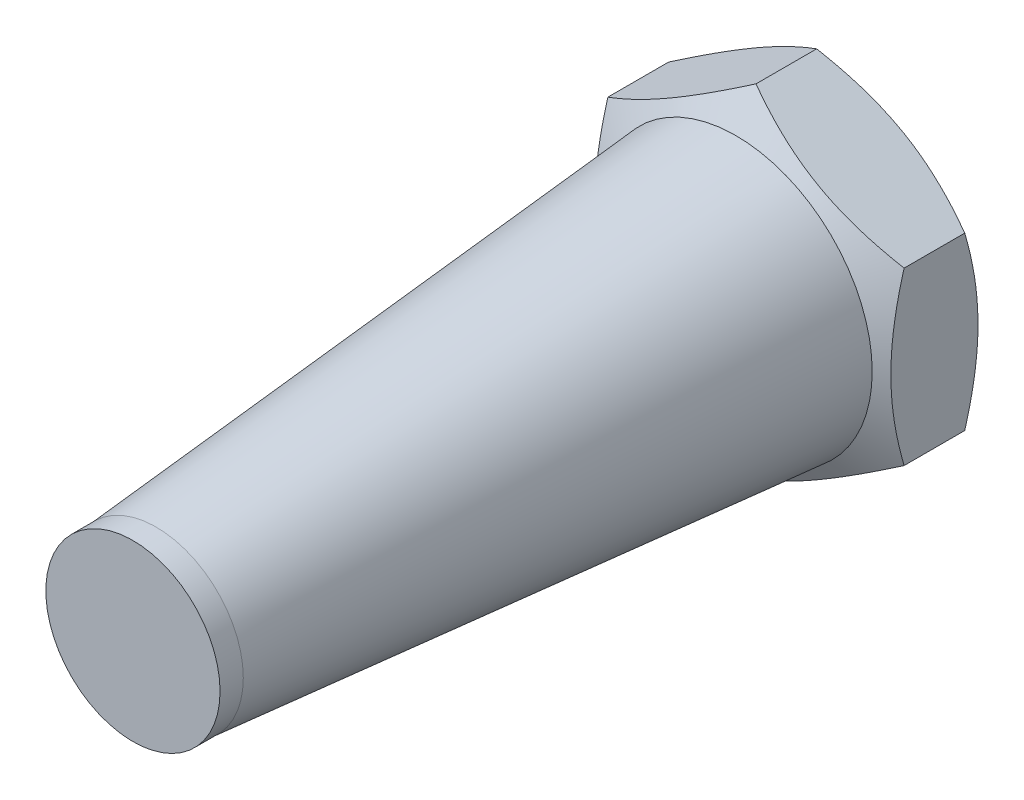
ISO-10303-21;
HEADER;
FILE_DESCRIPTION(('STEP AP214'),'2;1');
FILE_NAME('part.step','',(''),(''),'','','');
FILE_SCHEMA(('AUTOMOTIVE_DESIGN { 1 0 10303 214 1 1 1 1 }'));
ENDSEC;
DATA;
#1=APPLICATION_CONTEXT('core data for automotive mechanical design processes');
#2=APPLICATION_PROTOCOL_DEFINITION('international standard','automotive_design',2000,#1);
#3=PRODUCT_CONTEXT('',#1,'mechanical');
#4=PRODUCT('Part','Part','',(#3));
#5=PRODUCT_RELATED_PRODUCT_CATEGORY('part','',(#4));
#6=PRODUCT_DEFINITION_FORMATION('','',#4);
#7=PRODUCT_DEFINITION_CONTEXT('part definition',#1,'design');
#8=PRODUCT_DEFINITION('design','',#6,#7);
#9=PRODUCT_DEFINITION_SHAPE('','',#8);
#10=(LENGTH_UNIT() NAMED_UNIT(*) SI_UNIT(.MILLI.,.METRE.));
#11=(NAMED_UNIT(*) PLANE_ANGLE_UNIT() SI_UNIT($,.RADIAN.));
#12=(NAMED_UNIT(*) SI_UNIT($,.STERADIAN.) SOLID_ANGLE_UNIT());
#13=UNCERTAINTY_MEASURE_WITH_UNIT(LENGTH_MEASURE(1.E-05),#10,'distance_accuracy_value','');
#14=(GEOMETRIC_REPRESENTATION_CONTEXT(3) GLOBAL_UNCERTAINTY_ASSIGNED_CONTEXT((#13)) GLOBAL_UNIT_ASSIGNED_CONTEXT((#10,
#11,#12)) REPRESENTATION_CONTEXT('',''));
#15=CARTESIAN_POINT('',(0.,0.,0.));
#16=DIRECTION('',(0.,0.,1.));
#17=DIRECTION('',(1.,0.,0.));
#18=AXIS2_PLACEMENT_3D('',#15,#16,#17);
#19=CARTESIAN_POINT('',(0.,0.,2.5));
#20=DIRECTION('',(0.,0.,-1.));
#21=DIRECTION('',(-0.5,0.866025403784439,0.));
#22=AXIS2_PLACEMENT_3D('',#19,#20,#21);
#23=CONICAL_SURFACE('',#22,12.830127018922,1.04719755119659);
#24=CARTESIAN_POINT('',(0.,0.,5.3925981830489));
#25=DIRECTION('',(0.,0.,-1.));
#26=DIRECTION('',(-0.5,0.866025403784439,0.));
#27=AXIS2_PLACEMENT_3D('',#24,#25,#26);
#28=CIRCLE('',#27,7.82);
#29=CARTESIAN_POINT('',(-3.91,6.77231865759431,5.3925981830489));
#30=VERTEX_POINT('',#29);
#31=EDGE_CURVE('E280',#30,#30,#28,.T.);
#32=ORIENTED_EDGE('',*,*,#31,.T.);
#33=EDGE_LOOP('',(#32));
#34=FACE_BOUND('',#33,.T.);
#35=CARTESIAN_POINT('',(-15.6843801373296,0.759573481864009,0.841483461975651));
#36=CARTESIAN_POINT('',(-15.3627013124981,0.945294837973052,1.02175161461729));
#37=CARTESIAN_POINT('',(-15.0402860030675,1.13144140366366,1.20029735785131));
#38=CARTESIAN_POINT('',(-14.393590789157,1.50481105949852,1.55297568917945));
#39=CARTESIAN_POINT('',(-14.0693106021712,1.69203431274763,1.72710758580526));
#40=CARTESIAN_POINT('',(-13.4168321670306,2.06874291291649,2.07086132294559));
#41=CARTESIAN_POINT('',(-13.0886222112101,2.25823501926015,2.24045363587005));
#42=CARTESIAN_POINT('',(-12.4295981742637,2.63872272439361,2.57272585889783));
#43=CARTESIAN_POINT('',(-12.0987842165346,2.8297182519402,2.73540609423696));
#44=CARTESIAN_POINT('',(-11.4233012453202,3.21970852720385,3.05713795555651));
#45=CARTESIAN_POINT('',(-11.0785294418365,3.41876262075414,3.21590342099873));
#46=CARTESIAN_POINT('',(-10.3849599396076,3.81919515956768,3.52146971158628));
#47=CARTESIAN_POINT('',(-10.0361617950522,4.02057386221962,3.66826919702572));
#48=CARTESIAN_POINT('',(-9.33462727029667,4.42560500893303,3.94606509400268));
#49=CARTESIAN_POINT('',(-8.98190043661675,4.62925194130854,4.07709330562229));
#50=CARTESIAN_POINT('',(-8.27139980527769,5.03945967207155,4.31915799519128));
#51=CARTESIAN_POINT('',(-7.91362762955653,5.24601953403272,4.43020074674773));
#52=CARTESIAN_POINT('',(-7.19475057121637,5.66106339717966,4.62638435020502));
#53=CARTESIAN_POINT('',(-6.83367521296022,5.86953035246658,4.71166556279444));
#54=CARTESIAN_POINT('',(-6.28875955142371,6.18413755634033,4.81658170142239));
#55=CARTESIAN_POINT('',(-6.10655739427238,6.28933202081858,4.84772087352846));
#56=CARTESIAN_POINT('',(-5.74124120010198,6.50024742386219,4.90172040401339));
#57=CARTESIAN_POINT('',(-5.55812725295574,6.60596831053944,4.92458156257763));
#58=CARTESIAN_POINT('',(-5.19363375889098,6.8164087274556,4.96128170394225));
#59=CARTESIAN_POINT('',(-5.01226286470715,6.9211232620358,4.97523481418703));
#60=CARTESIAN_POINT('',(-4.64917257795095,7.13075353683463,4.99427112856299));
#61=CARTESIAN_POINT('',(-4.4674531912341,7.23566927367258,4.99935448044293));
#62=CARTESIAN_POINT('',(-4.10399055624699,7.44551452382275,5.00052995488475));
#63=CARTESIAN_POINT('',(-3.92224730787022,7.55044403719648,4.996622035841));
#64=CARTESIAN_POINT('',(-3.55906551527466,7.7601271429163,4.97991072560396));
#65=CARTESIAN_POINT('',(-3.37762698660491,7.86488072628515,4.96710689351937));
#66=CARTESIAN_POINT('',(-2.94215561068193,8.11630024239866,4.92597203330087));
#67=CARTESIAN_POINT('',(-2.68841284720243,8.26279869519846,4.89345749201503));
#68=CARTESIAN_POINT('',(-2.18281025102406,8.55470849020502,4.81279848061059));
#69=CARTESIAN_POINT('',(-1.9309506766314,8.7001196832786,4.76465190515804));
#70=CARTESIAN_POINT('',(-1.17848665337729,9.13455498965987,4.59931707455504));
#71=CARTESIAN_POINT('',(-0.681275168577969,9.42162017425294,4.46126348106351));
#72=CARTESIAN_POINT('',(0.0622589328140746,9.8508997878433,4.22184160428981));
#73=CARTESIAN_POINT('',(0.312436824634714,9.99534006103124,4.13551884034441));
#74=CARTESIAN_POINT('',(0.810362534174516,10.2828176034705,3.95390295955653));
#75=CARTESIAN_POINT('',(1.05811033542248,10.4258548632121,3.85860978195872));
#76=CARTESIAN_POINT('',(1.55125424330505,10.7105716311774,3.66058253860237));
#77=CARTESIAN_POINT('',(1.79665108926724,10.8522515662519,3.55785090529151));
#78=CARTESIAN_POINT('',(2.28541069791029,11.134437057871,3.34615605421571));
#79=CARTESIAN_POINT('',(2.52877348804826,11.2749426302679,3.23719292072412));
#80=CARTESIAN_POINT('',(3.11764094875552,11.6149254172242,2.96624169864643));
#81=CARTESIAN_POINT('',(3.4622099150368,11.8138624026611,2.80154663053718));
#82=CARTESIAN_POINT('',(4.14830777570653,12.2099811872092,2.46389431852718));
#83=CARTESIAN_POINT('',(4.48983645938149,12.4071628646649,2.29093650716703));
#84=CARTESIAN_POINT('',(5.17044511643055,12.800112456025,1.93847167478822));
#85=CARTESIAN_POINT('',(5.50952445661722,12.9958800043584,1.75896302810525));
#86=CARTESIAN_POINT('',(6.18557463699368,13.3861977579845,1.39476540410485));
#87=CARTESIAN_POINT('',(6.52254552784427,13.5807479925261,1.21007655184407));
#88=CARTESIAN_POINT('',(7.19513914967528,13.9690701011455,0.83629760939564));
#89=CARTESIAN_POINT('',(7.53075981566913,14.1628407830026,0.647202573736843));
#90=CARTESIAN_POINT('',(8.2005408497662,14.5495390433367,0.265595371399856));
#91=CARTESIAN_POINT('',(8.5347012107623,14.7424666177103,0.0730831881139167));
#92=CARTESIAN_POINT('',(9.20174535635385,15.1275847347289,-0.314727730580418));
#93=CARTESIAN_POINT('',(9.5346293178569,15.3197753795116,-0.510026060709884));
#94=CARTESIAN_POINT('',(10.1993580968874,15.7035567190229,-0.902967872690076));
#95=CARTESIAN_POINT('',(10.5312029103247,15.8951474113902,-1.10061136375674));
#96=CARTESIAN_POINT('',(11.4671694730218,16.4355279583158,-1.66157272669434));
#97=CARTESIAN_POINT('',(12.0702656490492,16.7837256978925,-2.02717199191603));
#98=CARTESIAN_POINT('',(13.2742599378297,17.4788521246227,-2.76321984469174));
#99=CARTESIAN_POINT('',(13.8751579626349,17.8257807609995,-3.13366862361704));
#100=CARTESIAN_POINT('',(15.0736547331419,18.5177331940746,-3.87726457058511));
#101=CARTESIAN_POINT('',(15.671258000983,18.8627596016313,-4.25040203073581));
#102=CARTESIAN_POINT('',(16.8650668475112,19.5520054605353,-4.99955126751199));
#103=CARTESIAN_POINT('',(17.4612725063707,19.8962249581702,-5.37556287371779));
#104=CARTESIAN_POINT('',(18.0569685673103,20.2401502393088,-5.75263973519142));
#105=B_SPLINE_CURVE_WITH_KNOTS('',3,(#35,#36,#37,#38,#39,#40,#41,#42,#43,#44,#45,#46,#47,#48,
#49,#50,#51,#52,#53,#54,#55,#56,#57,#58,#59,#60,#61,#62,#63,#64,#65,#66,#67,#68,#69,#70,#71,#72,
#73,#74,#75,#76,#77,#78,#79,#80,#81,#82,#83,#84,#85,#86,#87,#88,#89,#90,#91,#92,#93,#94,#95,#96,
#97,#98,#99,#100,#101,#102,#103,#104),.UNSPECIFIED.,.F.,.F.,(4,2,2,2,2,2,2,2,2,2,2,2,2,2,2,2,2,
2,2,2,2,2,2,2,2,2,2,2,2,2,2,2,2,2,4),(0.,1.23864194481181,2.47747674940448,3.72301978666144,
4.9685041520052,6.25415012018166,7.53993983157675,8.82309192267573,10.1058405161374,
11.3814685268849,12.0193739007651,12.6572175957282,13.2867161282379,13.916204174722,
14.5456951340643,15.1752172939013,16.0591048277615,16.9431114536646,18.7120884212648,
19.6165193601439,20.5209564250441,21.4250990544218,22.3292294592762,23.6209420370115,
24.9127434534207,26.204867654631,27.4969606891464,28.7905813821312,30.0842083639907,
31.3776490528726,32.6710948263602,35.0306559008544,37.3903103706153,39.7437342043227,
42.0970195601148),.UNSPECIFIED.);
#106=CARTESIAN_POINT('',(0.,9.81495457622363,4.24081062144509));
#107=VERTEX_POINT('',#106);
#108=CARTESIAN_POINT('',(-8.5,4.90747728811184,4.24081062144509));
#109=VERTEX_POINT('',#108);
#110=EDGE_CURVE('E102',#107,#109,#105,.F.);
#111=ORIENTED_EDGE('',*,*,#110,.T.);
#112=CARTESIAN_POINT('',(-8.5,4.90770822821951,4.24074395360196));
#113=CARTESIAN_POINT('',(-8.5,4.69196487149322,4.30301386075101));
#114=CARTESIAN_POINT('',(-8.5,4.47541714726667,4.36245770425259));
#115=CARTESIAN_POINT('',(-8.5,4.04056304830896,4.47491488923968));
#116=CARTESIAN_POINT('',(-8.5,3.82225595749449,4.52792545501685));
#117=CARTESIAN_POINT('',(-8.5,3.1638393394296,4.67626661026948));
#118=CARTESIAN_POINT('',(-8.5,2.72113075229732,4.76064107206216));
#119=CARTESIAN_POINT('',(-8.5,2.05862591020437,4.85957998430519));
#120=CARTESIAN_POINT('',(-8.5,1.84080885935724,4.88776480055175));
#121=CARTESIAN_POINT('',(-8.5,1.4041897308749,4.93502591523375));
#122=CARTESIAN_POINT('',(-8.5,1.18538774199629,4.95410301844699));
#123=CARTESIAN_POINT('',(-8.5,0.747407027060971,4.98266522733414));
#124=CARTESIAN_POINT('',(-8.5,0.528229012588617,4.99216121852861));
#125=CARTESIAN_POINT('',(-8.5,0.0896705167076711,5.0013576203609));
#126=CARTESIAN_POINT('',(-8.5,-0.129709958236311,5.0010583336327));
#127=CARTESIAN_POINT('',(-8.5,-0.539849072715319,4.99134552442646));
#128=CARTESIAN_POINT('',(-8.5,-0.730636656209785,4.98311683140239));
#129=CARTESIAN_POINT('',(-8.5,-1.11176497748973,4.95941075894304));
#130=CARTESIAN_POINT('',(-8.5,-1.30210568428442,4.94393289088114));
#131=CARTESIAN_POINT('',(-8.5,-1.87239091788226,4.88699137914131));
#132=CARTESIAN_POINT('',(-8.5,-2.25132599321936,4.83502693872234));
#133=CARTESIAN_POINT('',(-8.5,-3.01321579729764,4.705115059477));
#134=CARTESIAN_POINT('',(-8.5,-3.39607329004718,4.6266169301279));
#135=CARTESIAN_POINT('',(-8.5,-4.156078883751,4.44845866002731));
#136=CARTESIAN_POINT('',(-8.5,-4.53323671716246,4.34884036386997));
#137=CARTESIAN_POINT('',(-8.5,-4.90770822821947,4.24074395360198));
#138=B_SPLINE_CURVE_WITH_KNOTS('',3,(#112,#113,#114,#115,#116,#117,#118,#119,#120,#121,#122,
#123,#124,#125,#126,#127,#128,#129,#130,#131,#132,#133,#134,#135,#136,#137),.UNSPECIFIED.,.F.,
.F.,(4,2,2,2,2,2,2,2,2,2,2,2,4),(0.,0.673596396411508,1.34748239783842,2.69805431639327,
3.35679995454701,4.01548737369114,4.67342558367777,5.33134346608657,5.9040955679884,
6.47688628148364,7.62328361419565,8.79510569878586,9.96462743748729),.UNSPECIFIED.);
#139=CARTESIAN_POINT('',(-8.5,-4.9074772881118,4.2408106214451));
#140=VERTEX_POINT('',#139);
#141=EDGE_CURVE('E93',#109,#140,#138,.T.);
#142=ORIENTED_EDGE('',*,*,#141,.T.);
#143=CARTESIAN_POINT('',(-8.5002,-4.90736181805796,4.24074395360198));
#144=CARTESIAN_POINT('',(-8.31336077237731,-5.0152334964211,4.30301386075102));
#145=CARTESIAN_POINT('',(-8.1258249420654,-5.12350735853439,4.3624577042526));
#146=CARTESIAN_POINT('',(-7.74923024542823,-5.34093440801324,4.47491488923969));
#147=CARTESIAN_POINT('',(-7.56017075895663,-5.45008795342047,4.52792545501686));
#148=CARTESIAN_POINT('',(-6.9899652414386,-5.77929626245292,4.67626661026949));
#149=CARTESIAN_POINT('',(-6.60656835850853,-6.00065055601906,4.76064107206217));
#150=CARTESIAN_POINT('',(-6.03282233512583,-6.33190297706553,4.8595799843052));
#151=CARTESIAN_POINT('',(-5.8441872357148,-6.4408115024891,4.88776480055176));
#152=CARTESIAN_POINT('',(-5.46606397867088,-6.65912106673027,4.93502591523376));
#153=CARTESIAN_POINT('',(-5.27657589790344,-6.76852206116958,4.954103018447));
#154=CARTESIAN_POINT('',(-4.89727347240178,-6.98751241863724,4.98266522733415));
#155=CARTESIAN_POINT('',(-4.70745974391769,-7.09710142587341,4.99216121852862));
#156=CARTESIAN_POINT('',(-4.3276569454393,-7.31638067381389,5.00135762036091));
#157=CARTESIAN_POINT('',(-4.13766788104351,-7.42607091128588,5.0010583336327));
#158=CARTESIAN_POINT('',(-3.78247698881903,-7.63114046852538,4.99134552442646));
#159=CARTESIAN_POINT('',(-3.61725009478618,-7.72653426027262,4.9831168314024));
#160=CARTESIAN_POINT('',(-3.28718328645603,-7.91709842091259,4.95941075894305));
#161=CARTESIAN_POINT('',(-3.12234339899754,-8.01226877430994,4.94393289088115));
#162=CARTESIAN_POINT('',(-2.62846189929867,-8.29741139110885,4.88699137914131));
#163=CARTESIAN_POINT('',(-2.30029449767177,-8.48687892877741,4.83502693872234));
#164=CARTESIAN_POINT('',(-1.64047857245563,-8.86782383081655,4.705115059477));
#165=CARTESIAN_POINT('',(-1.3089142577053,-9.05925257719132,4.62661693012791));
#166=CARTESIAN_POINT('',(-0.65073010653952,-9.43925537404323,4.44845866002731));
#167=CARTESIAN_POINT('',(-0.324101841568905,-9.62783429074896,4.34884036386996));
#168=CARTESIAN_POINT('',(0.00020000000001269,-9.81507004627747,4.24074395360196));
#169=B_SPLINE_CURVE_WITH_KNOTS('',3,(#143,#144,#145,#146,#147,#148,#149,#150,#151,#152,#153,
#154,#155,#156,#157,#158,#159,#160,#161,#162,#163,#164,#165,#166,#167,#168),.UNSPECIFIED.,.F.,
.F.,(4,2,2,2,2,2,2,2,2,2,2,2,4),(0.,0.67359639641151,1.34748239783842,2.69805431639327,
3.35679995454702,4.01548737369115,4.67342558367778,5.33134346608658,5.90409556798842,
6.47688628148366,7.62328361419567,8.79510569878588,9.96462743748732),.UNSPECIFIED.);
#170=CARTESIAN_POINT('',(0.,-9.81495457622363,4.24081062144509));
#171=VERTEX_POINT('',#170);
#172=EDGE_CURVE('E82',#140,#171,#169,.T.);
#173=ORIENTED_EDGE('',*,*,#172,.T.);
#174=CARTESIAN_POINT('',(-7.18438013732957,-13.9628583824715,0.841483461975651));
#175=CARTESIAN_POINT('',(-6.86270131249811,-13.7771370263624,1.02175161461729));
#176=CARTESIAN_POINT('',(-6.54028600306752,-13.5909904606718,1.20029735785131));
#177=CARTESIAN_POINT('',(-5.89359078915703,-13.2176208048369,1.55297568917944));
#178=CARTESIAN_POINT('',(-5.56931060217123,-13.0303975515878,1.72710758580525));
#179=CARTESIAN_POINT('',(-4.91683216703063,-12.653688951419,2.07086132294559));
#180=CARTESIAN_POINT('',(-4.58862221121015,-12.4641968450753,2.24045363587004));
#181=CARTESIAN_POINT('',(-3.92959817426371,-12.0837091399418,2.57272585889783));
#182=CARTESIAN_POINT('',(-3.5987842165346,-11.8927136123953,2.73540609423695));
#183=CARTESIAN_POINT('',(-2.92330124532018,-11.5027233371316,3.05713795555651));
#184=CARTESIAN_POINT('',(-2.57852944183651,-11.3036692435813,3.21590342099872));
#185=CARTESIAN_POINT('',(-1.88495993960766,-10.9032367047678,3.52146971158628));
#186=CARTESIAN_POINT('',(-1.53616179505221,-10.7018580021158,3.66826919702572));
#187=CARTESIAN_POINT('',(-0.834627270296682,-10.2968268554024,3.94606509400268));
#188=CARTESIAN_POINT('',(-0.481900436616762,-10.0931799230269,4.07709330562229));
#189=CARTESIAN_POINT('',(0.228600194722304,-9.68297219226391,4.31915799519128));
#190=CARTESIAN_POINT('',(0.58637237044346,-9.47641233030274,4.43020074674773));
#191=CARTESIAN_POINT('',(1.30524942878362,-9.0613684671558,4.62638435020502));
#192=CARTESIAN_POINT('',(1.66632478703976,-8.85290151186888,4.71166556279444));
#193=CARTESIAN_POINT('',(2.21124044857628,-8.53829430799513,4.81658170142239));
#194=CARTESIAN_POINT('',(2.39344260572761,-8.43309984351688,4.84772087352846));
#195=CARTESIAN_POINT('',(2.75875879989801,-8.22218444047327,4.90172040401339));
#196=CARTESIAN_POINT('',(2.94187274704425,-8.11646355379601,4.92458156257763));
#197=CARTESIAN_POINT('',(3.30636624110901,-7.90602313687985,4.96128170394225));
#198=CARTESIAN_POINT('',(3.48773713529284,-7.80130860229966,4.97523481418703));
#199=CARTESIAN_POINT('',(3.85082742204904,-7.59167832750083,4.99427112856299));
#200=CARTESIAN_POINT('',(4.0325468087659,-7.48676259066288,4.99935448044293));
#201=CARTESIAN_POINT('',(4.396009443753,-7.27691734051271,5.00052995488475));
#202=CARTESIAN_POINT('',(4.57775269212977,-7.17198782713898,4.996622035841));
#203=CARTESIAN_POINT('',(4.94093448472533,-6.96230472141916,4.97991072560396));
#204=CARTESIAN_POINT('',(5.12237301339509,-6.85755113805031,4.96710689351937));
#205=CARTESIAN_POINT('',(5.55784438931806,-6.6061316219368,4.92597203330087));
#206=CARTESIAN_POINT('',(5.81158715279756,-6.459633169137,4.89345749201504));
#207=CARTESIAN_POINT('',(6.31718974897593,-6.16772337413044,4.81279848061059));
#208=CARTESIAN_POINT('',(6.56904932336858,-6.02231218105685,4.76465190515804));
#209=CARTESIAN_POINT('',(7.32151334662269,-5.58787687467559,4.59931707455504));
#210=CARTESIAN_POINT('',(7.81872483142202,-5.30081169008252,4.46126348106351));
#211=CARTESIAN_POINT('',(8.56225893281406,-4.87153207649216,4.22184160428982));
#212=CARTESIAN_POINT('',(8.81243682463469,-4.72709180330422,4.13551884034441));
#213=CARTESIAN_POINT('',(9.3103625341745,-4.43961426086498,3.95390295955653));
#214=CARTESIAN_POINT('',(9.55811033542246,-4.29657700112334,3.85860978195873));
#215=CARTESIAN_POINT('',(10.051254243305,-4.01186023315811,3.66058253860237));
#216=CARTESIAN_POINT('',(10.2966510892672,-3.87018029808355,3.55785090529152));
#217=CARTESIAN_POINT('',(10.7854106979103,-3.58799480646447,3.34615605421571));
#218=CARTESIAN_POINT('',(11.0287734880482,-3.44748923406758,3.23719292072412));
#219=CARTESIAN_POINT('',(11.6176409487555,-3.10750644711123,2.96624169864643));
#220=CARTESIAN_POINT('',(11.9622099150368,-2.90856946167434,2.80154663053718));
#221=CARTESIAN_POINT('',(12.6483077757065,-2.51245067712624,2.46389431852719));
#222=CARTESIAN_POINT('',(12.9898364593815,-2.31526899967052,2.29093650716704));
#223=CARTESIAN_POINT('',(13.6704451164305,-1.92231940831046,1.93847167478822));
#224=CARTESIAN_POINT('',(14.0095244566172,-1.72655185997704,1.75896302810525));
#225=CARTESIAN_POINT('',(14.6855746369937,-1.336234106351,1.39476540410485));
#226=CARTESIAN_POINT('',(15.0225455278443,-1.14168387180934,1.21007655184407));
#227=CARTESIAN_POINT('',(15.6951391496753,-0.753361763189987,0.836297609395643));
#228=CARTESIAN_POINT('',(16.0307598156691,-0.559591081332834,0.647202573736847));
#229=CARTESIAN_POINT('',(16.7005408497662,-0.172892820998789,0.26559537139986));
#230=CARTESIAN_POINT('',(17.0347012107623,0.020034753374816,0.0730831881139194));
#231=CARTESIAN_POINT('',(17.7017453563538,0.405152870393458,-0.314727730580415));
#232=CARTESIAN_POINT('',(18.0346293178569,0.597343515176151,-0.51002606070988));
#233=CARTESIAN_POINT('',(18.6993580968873,0.981124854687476,-0.902967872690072));
#234=CARTESIAN_POINT('',(19.0312029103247,1.17271554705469,-1.10061136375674));
#235=CARTESIAN_POINT('',(19.9671694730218,1.71309609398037,-1.66157272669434));
#236=CARTESIAN_POINT('',(20.5702656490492,2.06129383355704,-2.02717199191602));
#237=CARTESIAN_POINT('',(21.7742599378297,2.75642026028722,-2.76321984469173));
#238=CARTESIAN_POINT('',(22.3751579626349,3.10334889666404,-3.13366862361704));
#239=CARTESIAN_POINT('',(23.5736547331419,3.79530132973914,-3.87726457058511));
#240=CARTESIAN_POINT('',(24.171258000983,4.14032773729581,-4.25040203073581));
#241=CARTESIAN_POINT('',(25.3650668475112,4.82957359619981,-4.99955126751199));
#242=CARTESIAN_POINT('',(25.9612725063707,5.17379309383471,-5.37556287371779));
#243=CARTESIAN_POINT('',(26.5569685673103,5.51771837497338,-5.75263973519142));
#244=B_SPLINE_CURVE_WITH_KNOTS('',3,(#174,#175,#176,#177,#178,#179,#180,#181,#182,#183,#184,
#185,#186,#187,#188,#189,#190,#191,#192,#193,#194,#195,#196,#197,#198,#199,#200,#201,#202,#203,
#204,#205,#206,#207,#208,#209,#210,#211,#212,#213,#214,#215,#216,#217,#218,#219,#220,#221,#222,
#223,#224,#225,#226,#227,#228,#229,#230,#231,#232,#233,#234,#235,#236,#237,#238,#239,#240,#241,
#242,#243),.UNSPECIFIED.,.F.,.F.,(4,2,2,2,2,2,2,2,2,2,2,2,2,2,2,2,2,2,2,2,2,2,2,2,2,2,2,2,2,2,2,
2,2,2,4),(0.,1.23864194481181,2.47747674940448,3.72301978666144,4.96850415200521,
6.25415012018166,7.53993983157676,8.82309192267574,10.1058405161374,11.3814685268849,
12.0193739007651,12.6572175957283,13.2867161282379,13.916204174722,14.5456951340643,
15.1752172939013,16.0591048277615,16.9431114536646,18.7120884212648,19.6165193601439,
20.5209564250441,21.4250990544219,22.3292294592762,23.6209420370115,24.9127434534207,
26.204867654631,27.4969606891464,28.7905813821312,30.0842083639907,31.3776490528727,
32.6710948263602,35.0306559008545,37.3903103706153,39.7437342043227,42.0970195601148),.UNSPECIFIED.);
#245=CARTESIAN_POINT('',(8.5,-4.90747728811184,4.24081062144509));
#246=VERTEX_POINT('',#245);
#247=EDGE_CURVE('E229',#171,#246,#244,.T.);
#248=ORIENTED_EDGE('',*,*,#247,.T.);
#249=CARTESIAN_POINT('',(8.5,-4.90770822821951,4.24074395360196));
#250=CARTESIAN_POINT('',(8.5,-4.69196487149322,4.30301386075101));
#251=CARTESIAN_POINT('',(8.5,-4.47541714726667,4.36245770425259));
#252=CARTESIAN_POINT('',(8.5,-4.04056304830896,4.47491488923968));
#253=CARTESIAN_POINT('',(8.5,-3.82225595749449,4.52792545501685));
#254=CARTESIAN_POINT('',(8.5,-3.1638393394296,4.67626661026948));
#255=CARTESIAN_POINT('',(8.5,-2.72113075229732,4.76064107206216));
#256=CARTESIAN_POINT('',(8.5,-2.05862591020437,4.85957998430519));
#257=CARTESIAN_POINT('',(8.5,-1.84080885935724,4.88776480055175));
#258=CARTESIAN_POINT('',(8.5,-1.4041897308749,4.93502591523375));
#259=CARTESIAN_POINT('',(8.5,-1.18538774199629,4.95410301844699));
#260=CARTESIAN_POINT('',(8.5,-0.747407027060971,4.98266522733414));
#261=CARTESIAN_POINT('',(8.5,-0.528229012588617,4.99216121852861));
#262=CARTESIAN_POINT('',(8.5,-0.0896705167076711,5.0013576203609));
#263=CARTESIAN_POINT('',(8.5,0.129709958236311,5.0010583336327));
#264=CARTESIAN_POINT('',(8.5,0.539849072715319,4.99134552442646));
#265=CARTESIAN_POINT('',(8.5,0.730636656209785,4.98311683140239));
#266=CARTESIAN_POINT('',(8.5,1.11176497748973,4.95941075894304));
#267=CARTESIAN_POINT('',(8.5,1.30210568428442,4.94393289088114));
#268=CARTESIAN_POINT('',(8.5,1.87239091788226,4.88699137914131));
#269=CARTESIAN_POINT('',(8.5,2.25132599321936,4.83502693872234));
#270=CARTESIAN_POINT('',(8.5,3.01321579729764,4.705115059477));
#271=CARTESIAN_POINT('',(8.5,3.39607329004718,4.6266169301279));
#272=CARTESIAN_POINT('',(8.5,4.156078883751,4.44845866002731));
#273=CARTESIAN_POINT('',(8.5,4.53323671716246,4.34884036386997));
#274=CARTESIAN_POINT('',(8.5,4.90770822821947,4.24074395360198));
#275=B_SPLINE_CURVE_WITH_KNOTS('',3,(#249,#250,#251,#252,#253,#254,#255,#256,#257,#258,#259,
#260,#261,#262,#263,#264,#265,#266,#267,#268,#269,#270,#271,#272,#273,#274),.UNSPECIFIED.,.F.,
.F.,(4,2,2,2,2,2,2,2,2,2,2,2,4),(0.,0.673596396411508,1.34748239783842,2.69805431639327,
3.35679995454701,4.01548737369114,4.67342558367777,5.33134346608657,5.9040955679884,
6.47688628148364,7.62328361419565,8.79510569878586,9.96462743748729),.UNSPECIFIED.);
#276=CARTESIAN_POINT('',(8.5,4.9074772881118,4.2408106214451));
#277=VERTEX_POINT('',#276);
#278=EDGE_CURVE('E215',#246,#277,#275,.T.);
#279=ORIENTED_EDGE('',*,*,#278,.T.);
#280=CARTESIAN_POINT('',(8.5002,4.90736181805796,4.24074395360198));
#281=CARTESIAN_POINT('',(8.31336077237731,5.0152334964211,4.30301386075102));
#282=CARTESIAN_POINT('',(8.1258249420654,5.12350735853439,4.3624577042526));
#283=CARTESIAN_POINT('',(7.74923024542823,5.34093440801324,4.47491488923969));
#284=CARTESIAN_POINT('',(7.56017075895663,5.45008795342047,4.52792545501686));
#285=CARTESIAN_POINT('',(6.9899652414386,5.77929626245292,4.67626661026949));
#286=CARTESIAN_POINT('',(6.60656835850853,6.00065055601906,4.76064107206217));
#287=CARTESIAN_POINT('',(6.03282233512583,6.33190297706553,4.8595799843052));
#288=CARTESIAN_POINT('',(5.8441872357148,6.4408115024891,4.88776480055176));
#289=CARTESIAN_POINT('',(5.46606397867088,6.65912106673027,4.93502591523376));
#290=CARTESIAN_POINT('',(5.27657589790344,6.76852206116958,4.954103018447));
#291=CARTESIAN_POINT('',(4.89727347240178,6.98751241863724,4.98266522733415));
#292=CARTESIAN_POINT('',(4.70745974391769,7.09710142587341,4.99216121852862));
#293=CARTESIAN_POINT('',(4.3276569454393,7.31638067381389,5.00135762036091));
#294=CARTESIAN_POINT('',(4.13766788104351,7.42607091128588,5.0010583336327));
#295=CARTESIAN_POINT('',(3.78247698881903,7.63114046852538,4.99134552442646));
#296=CARTESIAN_POINT('',(3.61725009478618,7.72653426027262,4.9831168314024));
#297=CARTESIAN_POINT('',(3.28718328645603,7.91709842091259,4.95941075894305));
#298=CARTESIAN_POINT('',(3.12234339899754,8.01226877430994,4.94393289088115));
#299=CARTESIAN_POINT('',(2.62846189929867,8.29741139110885,4.88699137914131));
#300=CARTESIAN_POINT('',(2.30029449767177,8.48687892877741,4.83502693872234));
#301=CARTESIAN_POINT('',(1.64047857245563,8.86782383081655,4.705115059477));
#302=CARTESIAN_POINT('',(1.3089142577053,9.05925257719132,4.62661693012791));
#303=CARTESIAN_POINT('',(0.65073010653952,9.43925537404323,4.44845866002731));
#304=CARTESIAN_POINT('',(0.324101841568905,9.62783429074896,4.34884036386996));
#305=CARTESIAN_POINT('',(-0.00020000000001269,9.81507004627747,4.24074395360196));
#306=B_SPLINE_CURVE_WITH_KNOTS('',3,(#280,#281,#282,#283,#284,#285,#286,#287,#288,#289,#290,
#291,#292,#293,#294,#295,#296,#297,#298,#299,#300,#301,#302,#303,#304,#305),.UNSPECIFIED.,.F.,
.F.,(4,2,2,2,2,2,2,2,2,2,2,2,4),(0.,0.67359639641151,1.34748239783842,2.69805431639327,
3.35679995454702,4.01548737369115,4.67342558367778,5.33134346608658,5.90409556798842,
6.47688628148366,7.62328361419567,8.79510569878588,9.96462743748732),.UNSPECIFIED.);
#307=EDGE_CURVE('E188',#277,#107,#306,.T.);
#308=ORIENTED_EDGE('',*,*,#307,.T.);
#309=EDGE_LOOP('',(#111,#142,#173,#248,#279,#308));
#310=FACE_BOUND('',#309,.T.);
#311=ADVANCED_FACE('F14',(#34,#310),#23,.T.);
#312=CARTESIAN_POINT('',(0.,0.,40.));
#313=DIRECTION('',(0.,0.,1.));
#314=DIRECTION('',(0.5,-0.866025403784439,0.));
#315=AXIS2_PLACEMENT_3D('',#312,#313,#314);
#316=PLANE('',#315);
#317=CARTESIAN_POINT('',(0.,0.,40.));
#318=DIRECTION('',(0.,0.,-1.));
#319=DIRECTION('',(-0.5,0.866025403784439,0.));
#320=AXIS2_PLACEMENT_3D('',#317,#318,#319);
#321=CIRCLE('',#320,5.);
#322=CARTESIAN_POINT('',(-2.5,4.3301270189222,40.));
#323=VERTEX_POINT('',#322);
#324=EDGE_CURVE('E9',#323,#323,#321,.T.);
#325=ORIENTED_EDGE('',*,*,#324,.F.);
#326=EDGE_LOOP('',(#325));
#327=FACE_BOUND('',#326,.T.);
#328=ADVANCED_FACE('F16',(#327),#316,.T.);
#329=CARTESIAN_POINT('',(0.,0.,21.738));
#330=DIRECTION('',(0.,0.,-1.));
#331=DIRECTION('',(-0.5,0.866025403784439,0.));
#332=AXIS2_PLACEMENT_3D('',#329,#330,#331);
#333=CYLINDRICAL_SURFACE('',#332,5.);
#334=ORIENTED_EDGE('',*,*,#324,.T.);
#335=EDGE_LOOP('',(#334));
#336=FACE_BOUND('',#335,.T.);
#337=CARTESIAN_POINT('',(0.,0.,38.666666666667));
#338=DIRECTION('',(0.,0.,-1.));
#339=DIRECTION('',(-0.5,0.866025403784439,0.));
#340=AXIS2_PLACEMENT_3D('',#337,#338,#339);
#341=CIRCLE('',#340,5.);
#342=CARTESIAN_POINT('',(-2.5,4.3301270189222,38.666666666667));
#343=VERTEX_POINT('',#342);
#344=EDGE_CURVE('E22',#343,#343,#341,.T.);
#345=ORIENTED_EDGE('',*,*,#344,.F.);
#346=EDGE_LOOP('',(#345));
#347=FACE_BOUND('',#346,.T.);
#348=ADVANCED_FACE('F301',(#336,#347),#333,.T.);
#349=CARTESIAN_POINT('',(0.,0.,5.3925981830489));
#350=DIRECTION('',(0.,0.,-1.));
#351=DIRECTION('',(-0.5,0.866025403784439,0.));
#352=AXIS2_PLACEMENT_3D('',#349,#350,#351);
#353=CONICAL_SURFACE('',#352,7.82,0.084548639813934);
#354=ORIENTED_EDGE('',*,*,#344,.T.);
#355=EDGE_LOOP('',(#354));
#356=FACE_BOUND('',#355,.T.);
#357=ORIENTED_EDGE('',*,*,#31,.F.);
#358=EDGE_LOOP('',(#357));
#359=FACE_BOUND('',#358,.T.);
#360=ADVANCED_FACE('F131',(#356,#359),#353,.T.);
#361=CARTESIAN_POINT('',(-8.5,4.90747728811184,-40.));
#362=DIRECTION('',(-1.,0.,0.));
#363=DIRECTION('',(0.,-1.,0.));
#364=AXIS2_PLACEMENT_3D('',#361,#362,#363);
#365=PLANE('',#364);
#366=DIRECTION('',(0.,0.,1.));
#367=VECTOR('',#366,1.);
#368=CARTESIAN_POINT('',(-8.5,4.90747728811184,-40.));
#369=LINE('',#368,#367);
#370=CARTESIAN_POINT('',(-8.5,4.90747728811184,0.759189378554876));
#371=VERTEX_POINT('',#370);
#372=EDGE_CURVE('E258',#371,#109,#369,.T.);
#373=ORIENTED_EDGE('',*,*,#372,.F.);
#374=CARTESIAN_POINT('',(-8.5,-4.90770822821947,0.759256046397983));
#375=CARTESIAN_POINT('',(-8.5,-4.69196487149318,0.69698613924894));
#376=CARTESIAN_POINT('',(-8.5,-4.47541714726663,0.637542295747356));
#377=CARTESIAN_POINT('',(-8.5,-4.04056304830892,0.525085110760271));
#378=CARTESIAN_POINT('',(-8.5,-3.82225595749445,0.472074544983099));
#379=CARTESIAN_POINT('',(-8.5,-3.16383933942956,0.323733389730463));
#380=CARTESIAN_POINT('',(-8.5,-2.72113075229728,0.239358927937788));
#381=CARTESIAN_POINT('',(-8.5,-2.05862591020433,0.140420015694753));
#382=CARTESIAN_POINT('',(-8.5,-1.8408088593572,0.112235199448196));
#383=CARTESIAN_POINT('',(-8.5,-1.40418973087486,0.0649740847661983));
#384=CARTESIAN_POINT('',(-8.5,-1.18538774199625,0.045896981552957));
#385=CARTESIAN_POINT('',(-8.5,-0.747407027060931,0.0173347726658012));
#386=CARTESIAN_POINT('',(-8.5,-0.528229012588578,0.00783878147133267));
#387=CARTESIAN_POINT('',(-8.5,-0.0896705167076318,-0.00135762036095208));
#388=CARTESIAN_POINT('',(-8.5,0.12970995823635,-0.00105833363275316));
#389=CARTESIAN_POINT('',(-8.5,0.539849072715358,0.00865447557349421));
#390=CARTESIAN_POINT('',(-8.5,0.730636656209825,0.0168831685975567));
#391=CARTESIAN_POINT('',(-8.5,1.11176497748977,0.0405892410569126));
#392=CARTESIAN_POINT('',(-8.5,1.30210568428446,0.056067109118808));
#393=CARTESIAN_POINT('',(-8.5,1.8723909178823,0.113008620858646));
#394=CARTESIAN_POINT('',(-8.5,2.2513259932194,0.164973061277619));
#395=CARTESIAN_POINT('',(-8.5,3.01321579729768,0.294884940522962));
#396=CARTESIAN_POINT('',(-8.5,3.39607329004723,0.373383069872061));
#397=CARTESIAN_POINT('',(-8.5,4.15607888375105,0.551541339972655));
#398=CARTESIAN_POINT('',(-8.5,4.5332367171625,0.651159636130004));
#399=CARTESIAN_POINT('',(-8.5,4.90770822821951,0.759256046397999));
#400=B_SPLINE_CURVE_WITH_KNOTS('',3,(#374,#375,#376,#377,#378,#379,#380,#381,#382,#383,#384,
#385,#386,#387,#388,#389,#390,#391,#392,#393,#394,#395,#396,#397,#398,#399),.UNSPECIFIED.,.F.,
.F.,(4,2,2,2,2,2,2,2,2,2,2,2,4),(0.,0.673596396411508,1.34748239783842,2.69805431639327,
3.35679995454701,4.01548737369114,4.67342558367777,5.33134346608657,5.9040955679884,
6.47688628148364,7.62328361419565,8.79510569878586,9.9646274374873),.UNSPECIFIED.);
#401=CARTESIAN_POINT('',(-8.5,0.,0.));
#402=VERTEX_POINT('',#401);
#403=EDGE_CURVE('E109',#402,#371,#400,.T.);
#404=ORIENTED_EDGE('',*,*,#403,.F.);
#405=CARTESIAN_POINT('',(-8.5,-4.9074772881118,0.75918937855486));
#406=VERTEX_POINT('',#405);
#407=EDGE_CURVE('E96',#406,#402,#400,.T.);
#408=ORIENTED_EDGE('',*,*,#407,.F.);
#409=DIRECTION('',(0.,0.,1.));
#410=VECTOR('',#409,1.);
#411=CARTESIAN_POINT('',(-8.5,-4.9074772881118,-40.));
#412=LINE('',#411,#410);
#413=EDGE_CURVE('E35',#406,#140,#412,.T.);
#414=ORIENTED_EDGE('',*,*,#413,.T.);
#415=ORIENTED_EDGE('',*,*,#141,.F.);
#416=EDGE_LOOP('',(#373,#404,#408,#414,#415));
#417=FACE_BOUND('',#416,.T.);
#418=ADVANCED_FACE('F92',(#417),#365,.T.);
#419=CARTESIAN_POINT('',(0.,9.81495457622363,-40.));
#420=DIRECTION('',(-0.5,0.866025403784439,0.));
#421=DIRECTION('',(-0.866025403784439,-0.5,0.));
#422=AXIS2_PLACEMENT_3D('',#419,#420,#421);
#423=PLANE('',#422);
#424=DIRECTION('',(0.,0.,1.));
#425=VECTOR('',#424,1.);
#426=CARTESIAN_POINT('',(0.,9.81495457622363,-40.));
#427=LINE('',#426,#425);
#428=CARTESIAN_POINT('',(0.,9.81495457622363,0.759189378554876));
#429=VERTEX_POINT('',#428);
#430=EDGE_CURVE('E255',#429,#107,#427,.T.);
#431=ORIENTED_EDGE('',*,*,#430,.F.);
#432=CARTESIAN_POINT('',(-15.7320777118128,0.73203527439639,4.18526972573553));
#433=CARTESIAN_POINT('',(-15.4100128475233,0.917979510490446,4.00456511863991));
#434=CARTESIAN_POINT('',(-15.0872157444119,1.10434650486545,3.82557120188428));
#435=CARTESIAN_POINT('',(-14.4397679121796,1.478150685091,3.47196532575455));
#436=CARTESIAN_POINT('',(-14.1151169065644,1.66558803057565,3.29735404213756));
#437=CARTESIAN_POINT('',(-13.4619308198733,2.04270519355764,2.95261175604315));
#438=CARTESIAN_POINT('',(-13.1333842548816,2.23239164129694,2.78250966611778));
#439=CARTESIAN_POINT('',(-12.4737011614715,2.61325985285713,2.44916508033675));
#440=CARTESIAN_POINT('',(-12.1425647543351,2.80444154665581,2.28592226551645));
#441=CARTESIAN_POINT('',(-11.4662185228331,3.19493022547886,1.9628712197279));
#442=CARTESIAN_POINT('',(-11.1209042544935,3.39429751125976,1.80335295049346));
#443=CARTESIAN_POINT('',(-10.4262610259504,3.79534996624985,1.49620558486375));
#444=CARTESIAN_POINT('',(-10.0769316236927,3.99703539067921,1.34857781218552));
#445=CARTESIAN_POINT('',(-9.37433096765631,4.40268206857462,1.0690316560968));
#446=CARTESIAN_POINT('',(-9.02106911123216,4.60663789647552,0.937082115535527));
#447=CARTESIAN_POINT('',(-8.30949064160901,5.017467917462,0.693074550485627));
#448=CARTESIAN_POINT('',(-7.95117563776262,5.22434118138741,0.581010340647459));
#449=CARTESIAN_POINT('',(-7.23123945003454,5.63999653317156,0.382710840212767));
#450=CARTESIAN_POINT('',(-6.86964872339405,5.84876103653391,0.296332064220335));
#451=CARTESIAN_POINT('',(-6.32391747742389,6.16383911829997,0.189725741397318));
#452=CARTESIAN_POINT('',(-6.14143658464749,6.26919451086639,0.1580158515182));
#453=CARTESIAN_POINT('',(-5.77554547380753,6.48044184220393,0.102870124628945));
#454=CARTESIAN_POINT('',(-5.59213534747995,6.58633372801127,0.0794334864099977));
#455=CARTESIAN_POINT('',(-5.22705618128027,6.79711228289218,0.0415991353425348));
#456=CARTESIAN_POINT('',(-5.04539613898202,6.90199375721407,0.0270861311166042));
#457=CARTESIAN_POINT('',(-4.68170712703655,7.11196970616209,0.00694756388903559));
#458=CARTESIAN_POINT('',(-4.49967816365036,7.21706417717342,0.00132185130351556));
#459=CARTESIAN_POINT('',(-4.13557743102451,7.4272778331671,-0.000907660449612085));
#460=CARTESIAN_POINT('',(-3.95350566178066,7.53239701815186,0.00248854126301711));
#461=CARTESIAN_POINT('',(-3.58964970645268,7.74246935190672,0.0182187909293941));
#462=CARTESIAN_POINT('',(-3.40786553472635,7.84742249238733,0.030553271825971));
#463=CARTESIAN_POINT('',(-2.972962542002,8.09851385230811,0.0704916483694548));
#464=CARTESIAN_POINT('',(-2.72012089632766,8.24449204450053,0.102209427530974));
#465=CARTESIAN_POINT('',(-2.21628297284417,8.53538300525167,0.181223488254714));
#466=CARTESIAN_POINT('',(-1.96528694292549,8.68029563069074,0.228521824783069));
#467=CARTESIAN_POINT('',(-1.21537084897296,9.11325988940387,0.391282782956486));
#468=CARTESIAN_POINT('',(-0.719796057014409,9.39938012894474,0.527582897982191));
#469=CARTESIAN_POINT('',(0.0212870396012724,9.82724465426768,0.764399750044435));
#470=CARTESIAN_POINT('',(0.270629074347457,9.97120234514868,0.849844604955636));
#471=CARTESIAN_POINT('',(0.766892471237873,10.2577201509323,1.02972598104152));
#472=CARTESIAN_POINT('',(1.0138138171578,10.4002802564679,1.1241625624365));
#473=CARTESIAN_POINT('',(1.50531126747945,10.6840464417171,1.32050253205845));
#474=CARTESIAN_POINT('',(1.74988809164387,10.8252529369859,1.42240353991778));
#475=CARTESIAN_POINT('',(2.23700882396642,11.1064922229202,1.63246178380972));
#476=CARTESIAN_POINT('',(2.47955275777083,11.2465250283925,1.74061894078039));
#477=CARTESIAN_POINT('',(3.05882925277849,11.5809704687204,2.00615790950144));
#478=CARTESIAN_POINT('',(3.39470517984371,11.7748885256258,2.16602701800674));
#479=CARTESIAN_POINT('',(4.06353096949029,12.1610352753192,2.49375196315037));
#480=CARTESIAN_POINT('',(4.39648063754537,12.3532638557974,2.66160832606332));
#481=CARTESIAN_POINT('',(5.06000926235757,12.7363522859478,3.00368299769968));
#482=CARTESIAN_POINT('',(5.39058762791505,12.9272117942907,3.17790283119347));
#483=CARTESIAN_POINT('',(6.04969569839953,13.3077480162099,3.53139949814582));
#484=CARTESIAN_POINT('',(6.37822545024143,13.4974247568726,3.71067621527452));
#485=CARTESIAN_POINT('',(7.03396102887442,13.8760138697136,4.07353479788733));
#486=CARTESIAN_POINT('',(7.3611648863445,14.0649251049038,4.2571214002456));
#487=CARTESIAN_POINT('',(8.01414021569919,14.441920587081,4.62765894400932));
#488=CARTESIAN_POINT('',(8.3399116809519,14.6300048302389,4.81460990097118));
#489=CARTESIAN_POINT('',(9.31533494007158,15.1931657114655,5.37954999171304));
#490=CARTESIAN_POINT('',(9.96318851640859,15.5672041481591,5.76167820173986));
#491=CARTESIAN_POINT('',(11.1998458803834,16.2811886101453,6.50045352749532));
#492=CARTESIAN_POINT('',(11.7889356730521,16.6212997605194,6.8564652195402));
#493=CARTESIAN_POINT('',(12.9649231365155,17.3002564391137,7.57334253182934));
#494=CARTESIAN_POINT('',(13.5518207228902,17.6391019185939,7.9342083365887));
#495=CARTESIAN_POINT('',(14.7223733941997,18.314920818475,8.65867559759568));
#496=CARTESIAN_POINT('',(15.3060329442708,18.6518968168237,9.02226745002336));
#497=CARTESIAN_POINT('',(16.4719543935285,19.3250418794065,9.75233522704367));
#498=CARTESIAN_POINT('',(17.054216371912,19.6612109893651,10.1188109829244));
#499=CARTESIAN_POINT('',(17.6359662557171,19.9970844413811,10.4863601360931));
#500=B_SPLINE_CURVE_WITH_KNOTS('',3,(#432,#433,#434,#435,#436,#437,#438,#439,#440,#441,#442,
#443,#444,#445,#446,#447,#448,#449,#450,#451,#452,#453,#454,#455,#456,#457,#458,#459,#460,#461,
#462,#463,#464,#465,#466,#467,#468,#469,#470,#471,#472,#473,#474,#475,#476,#477,#478,#479,#480,
#481,#482,#483,#484,#485,#486,#487,#488,#489,#490,#491,#492,#493,#494,#495,#496,#497,#498,#499),
.UNSPECIFIED.,.F.,.F.,(4,2,2,2,2,2,2,2,2,2,2,2,2,2,2,2,2,2,2,2,2,2,2,2,2,2,2,2,2,2,2,2,2,4),(0.,
1.24041661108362,2.48102332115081,3.72825657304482,4.97543176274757,6.26366261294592,
7.55203667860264,8.83780596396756,10.1231746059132,11.4012218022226,12.0403353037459,
12.6793868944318,13.3099983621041,13.9405992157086,14.5712001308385,15.2018315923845,
16.0823582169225,16.9630010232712,18.725232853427,19.6261358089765,20.5270447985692,
21.4276677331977,22.3282792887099,23.586638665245,24.8450810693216,26.1038270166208,
27.3625440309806,28.6227160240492,29.8828938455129,32.402892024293,34.7061342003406,
37.0094641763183,39.306779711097,41.6039618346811),.UNSPECIFIED.);
#501=CARTESIAN_POINT('',(-4.25,7.36121593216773,0.));
#502=VERTEX_POINT('',#501);
#503=EDGE_CURVE('E180',#502,#429,#500,.T.);
#504=ORIENTED_EDGE('',*,*,#503,.F.);
#505=EDGE_CURVE('E187',#371,#502,#500,.T.);
#506=ORIENTED_EDGE('',*,*,#505,.F.);
#507=ORIENTED_EDGE('',*,*,#372,.T.);
#508=ORIENTED_EDGE('',*,*,#110,.F.);
#509=EDGE_LOOP('',(#431,#504,#506,#507,#508));
#510=FACE_BOUND('',#509,.T.);
#511=ADVANCED_FACE('F130',(#510),#423,.T.);
#512=CARTESIAN_POINT('',(8.5,4.9074772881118,-40.));
#513=DIRECTION('',(0.5,0.866025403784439,0.));
#514=DIRECTION('',(-0.866025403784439,0.5,0.));
#515=AXIS2_PLACEMENT_3D('',#512,#513,#514);
#516=PLANE('',#515);
#517=DIRECTION('',(0.,0.,1.));
#518=VECTOR('',#517,1.);
#519=CARTESIAN_POINT('',(8.5,4.9074772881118,-40.));
#520=LINE('',#519,#518);
#521=CARTESIAN_POINT('',(8.5,4.9074772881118,0.75918937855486));
#522=VERTEX_POINT('',#521);
#523=EDGE_CURVE('E250',#522,#277,#520,.T.);
#524=ORIENTED_EDGE('',*,*,#523,.F.);
#525=CARTESIAN_POINT('',(-0.00020000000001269,9.81507004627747,0.759256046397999));
#526=CARTESIAN_POINT('',(0.186639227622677,9.70719836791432,0.696986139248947));
#527=CARTESIAN_POINT('',(0.374175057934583,9.59892450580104,0.637542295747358));
#528=CARTESIAN_POINT('',(0.750769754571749,9.38149745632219,0.525085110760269));
#529=CARTESIAN_POINT('',(0.939829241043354,9.27234391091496,0.472074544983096));
#530=CARTESIAN_POINT('',(1.51003475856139,8.94313560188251,0.32373338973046));
#531=CARTESIAN_POINT('',(1.89343164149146,8.72178130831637,0.239358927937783));
#532=CARTESIAN_POINT('',(2.46717766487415,8.39052888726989,0.140420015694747));
#533=CARTESIAN_POINT('',(2.65581276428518,8.28162036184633,0.112235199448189));
#534=CARTESIAN_POINT('',(3.03393602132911,8.06331079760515,0.0649740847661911));
#535=CARTESIAN_POINT('',(3.22342410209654,7.95390980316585,0.0458969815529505));
#536=CARTESIAN_POINT('',(3.6027265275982,7.73491944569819,0.0173347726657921));
#537=CARTESIAN_POINT('',(3.7925402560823,7.62533043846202,0.00783878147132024));
#538=CARTESIAN_POINT('',(4.17234305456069,7.40605119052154,-0.00135762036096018));
#539=CARTESIAN_POINT('',(4.36233211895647,7.29636095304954,-0.00105833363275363));
#540=CARTESIAN_POINT('',(4.71752301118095,7.09129139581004,0.00865447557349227));
#541=CARTESIAN_POINT('',(4.8827499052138,6.99589760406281,0.0168831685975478));
#542=CARTESIAN_POINT('',(5.21281671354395,6.80533344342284,0.0405892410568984));
#543=CARTESIAN_POINT('',(5.37765660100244,6.71016309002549,0.0560671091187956));
#544=CARTESIAN_POINT('',(5.87153810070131,6.42502047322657,0.113008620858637));
#545=CARTESIAN_POINT('',(6.19970550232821,6.23555293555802,0.164973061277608));
#546=CARTESIAN_POINT('',(6.85952142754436,5.85460803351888,0.294884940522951));
#547=CARTESIAN_POINT('',(7.19108574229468,5.66317928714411,0.37338306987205));
#548=CARTESIAN_POINT('',(7.84926989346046,5.2831764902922,0.551541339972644));
#549=CARTESIAN_POINT('',(8.17589815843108,5.09459757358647,0.651159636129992));
#550=CARTESIAN_POINT('',(8.5002,4.90736181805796,0.759256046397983));
#551=B_SPLINE_CURVE_WITH_KNOTS('',3,(#525,#526,#527,#528,#529,#530,#531,#532,#533,#534,#535,
#536,#537,#538,#539,#540,#541,#542,#543,#544,#545,#546,#547,#548,#549,#550),.UNSPECIFIED.,.F.,
.F.,(4,2,2,2,2,2,2,2,2,2,2,2,4),(0.,0.673596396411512,1.34748239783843,2.69805431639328,
3.35679995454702,4.01548737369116,4.67342558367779,5.33134346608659,5.90409556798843,
6.47688628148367,7.62328361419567,8.79510569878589,9.96462743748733),.UNSPECIFIED.);
#552=CARTESIAN_POINT('',(4.25,7.36121593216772,0.));
#553=VERTEX_POINT('',#552);
#554=EDGE_CURVE('E172',#553,#522,#551,.T.);
#555=ORIENTED_EDGE('',*,*,#554,.F.);
#556=EDGE_CURVE('E223',#429,#553,#551,.T.);
#557=ORIENTED_EDGE('',*,*,#556,.F.);
#558=ORIENTED_EDGE('',*,*,#430,.T.);
#559=ORIENTED_EDGE('',*,*,#307,.F.);
#560=EDGE_LOOP('',(#524,#555,#557,#558,#559));
#561=FACE_BOUND('',#560,.T.);
#562=ADVANCED_FACE('F200',(#561),#516,.T.);
#563=CARTESIAN_POINT('',(8.5,-4.90747728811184,-40.));
#564=DIRECTION('',(1.,0.,0.));
#565=DIRECTION('',(0.,1.,0.));
#566=AXIS2_PLACEMENT_3D('',#563,#564,#565);
#567=PLANE('',#566);
#568=DIRECTION('',(0.,0.,1.));
#569=VECTOR('',#568,1.);
#570=CARTESIAN_POINT('',(8.5,-4.90747728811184,-40.));
#571=LINE('',#570,#569);
#572=CARTESIAN_POINT('',(8.5,-4.90747728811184,0.759189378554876));
#573=VERTEX_POINT('',#572);
#574=EDGE_CURVE('E248',#573,#246,#571,.T.);
#575=ORIENTED_EDGE('',*,*,#574,.F.);
#576=CARTESIAN_POINT('',(8.5,4.90770822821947,0.759256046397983));
#577=CARTESIAN_POINT('',(8.5,4.69196487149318,0.69698613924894));
#578=CARTESIAN_POINT('',(8.5,4.47541714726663,0.637542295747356));
#579=CARTESIAN_POINT('',(8.5,4.04056304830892,0.525085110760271));
#580=CARTESIAN_POINT('',(8.5,3.82225595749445,0.472074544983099));
#581=CARTESIAN_POINT('',(8.5,3.16383933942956,0.323733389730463));
#582=CARTESIAN_POINT('',(8.5,2.72113075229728,0.239358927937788));
#583=CARTESIAN_POINT('',(8.5,2.05862591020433,0.140420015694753));
#584=CARTESIAN_POINT('',(8.5,1.8408088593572,0.112235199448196));
#585=CARTESIAN_POINT('',(8.5,1.40418973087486,0.0649740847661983));
#586=CARTESIAN_POINT('',(8.5,1.18538774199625,0.045896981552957));
#587=CARTESIAN_POINT('',(8.5,0.747407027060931,0.0173347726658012));
#588=CARTESIAN_POINT('',(8.5,0.528229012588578,0.00783878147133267));
#589=CARTESIAN_POINT('',(8.5,0.0896705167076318,-0.00135762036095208));
#590=CARTESIAN_POINT('',(8.5,-0.12970995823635,-0.00105833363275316));
#591=CARTESIAN_POINT('',(8.5,-0.539849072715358,0.00865447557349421));
#592=CARTESIAN_POINT('',(8.5,-0.730636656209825,0.0168831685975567));
#593=CARTESIAN_POINT('',(8.5,-1.11176497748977,0.0405892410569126));
#594=CARTESIAN_POINT('',(8.5,-1.30210568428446,0.056067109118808));
#595=CARTESIAN_POINT('',(8.5,-1.8723909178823,0.113008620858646));
#596=CARTESIAN_POINT('',(8.5,-2.2513259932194,0.164973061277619));
#597=CARTESIAN_POINT('',(8.5,-3.01321579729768,0.294884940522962));
#598=CARTESIAN_POINT('',(8.5,-3.39607329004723,0.373383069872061));
#599=CARTESIAN_POINT('',(8.5,-4.15607888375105,0.551541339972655));
#600=CARTESIAN_POINT('',(8.5,-4.5332367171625,0.651159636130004));
#601=CARTESIAN_POINT('',(8.5,-4.90770822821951,0.759256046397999));
#602=B_SPLINE_CURVE_WITH_KNOTS('',3,(#576,#577,#578,#579,#580,#581,#582,#583,#584,#585,#586,
#587,#588,#589,#590,#591,#592,#593,#594,#595,#596,#597,#598,#599,#600,#601),.UNSPECIFIED.,.F.,
.F.,(4,2,2,2,2,2,2,2,2,2,2,2,4),(0.,0.673596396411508,1.34748239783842,2.69805431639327,
3.35679995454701,4.01548737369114,4.67342558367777,5.33134346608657,5.9040955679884,
6.47688628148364,7.62328361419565,8.79510569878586,9.9646274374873),.UNSPECIFIED.);
#603=CARTESIAN_POINT('',(8.5,0.,0.));
#604=VERTEX_POINT('',#603);
#605=EDGE_CURVE('E164',#604,#573,#602,.T.);
#606=ORIENTED_EDGE('',*,*,#605,.F.);
#607=EDGE_CURVE('E221',#522,#604,#602,.T.);
#608=ORIENTED_EDGE('',*,*,#607,.F.);
#609=ORIENTED_EDGE('',*,*,#523,.T.);
#610=ORIENTED_EDGE('',*,*,#278,.F.);
#611=EDGE_LOOP('',(#575,#606,#608,#609,#610));
#612=FACE_BOUND('',#611,.T.);
#613=ADVANCED_FACE('F206',(#612),#567,.T.);
#614=CARTESIAN_POINT('',(0.,-9.81495457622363,-40.));
#615=DIRECTION('',(0.5,-0.866025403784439,0.));
#616=DIRECTION('',(0.866025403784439,0.5,0.));
#617=AXIS2_PLACEMENT_3D('',#614,#615,#616);
#618=PLANE('',#617);
#619=DIRECTION('',(0.,0.,1.));
#620=VECTOR('',#619,1.);
#621=CARTESIAN_POINT('',(0.,-9.81495457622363,-40.));
#622=LINE('',#621,#620);
#623=CARTESIAN_POINT('',(0.,-9.81495457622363,0.759189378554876));
#624=VERTEX_POINT('',#623);
#625=EDGE_CURVE('E29',#624,#171,#622,.T.);
#626=ORIENTED_EDGE('',*,*,#625,.F.);
#627=CARTESIAN_POINT('',(-7.23207771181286,-13.9903965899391,4.18526972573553));
#628=CARTESIAN_POINT('',(-6.91001284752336,-13.804452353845,4.00456511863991));
#629=CARTESIAN_POINT('',(-6.58721574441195,-13.61808535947,3.82557120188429));
#630=CARTESIAN_POINT('',(-5.93976791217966,-13.2442811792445,3.47196532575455));
#631=CARTESIAN_POINT('',(-5.6151169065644,-13.0568438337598,3.29735404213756));
#632=CARTESIAN_POINT('',(-4.96193081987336,-12.6797266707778,2.95261175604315));
#633=CARTESIAN_POINT('',(-4.63338425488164,-12.4900402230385,2.78250966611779));
#634=CARTESIAN_POINT('',(-3.97370116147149,-12.1091720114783,2.44916508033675));
#635=CARTESIAN_POINT('',(-3.64256475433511,-11.9179903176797,2.28592226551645));
#636=CARTESIAN_POINT('',(-2.96621852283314,-11.5275016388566,1.9628712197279));
#637=CARTESIAN_POINT('',(-2.62090425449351,-11.3281343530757,1.80335295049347));
#638=CARTESIAN_POINT('',(-1.92626102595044,-10.9270818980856,1.49620558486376));
#639=CARTESIAN_POINT('',(-1.57693162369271,-10.7253964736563,1.34857781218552));
#640=CARTESIAN_POINT('',(-0.874330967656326,-10.3197497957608,1.06903165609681));
#641=CARTESIAN_POINT('',(-0.521069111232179,-10.1157939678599,0.93708211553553));
#642=CARTESIAN_POINT('',(0.19050935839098,-9.70496394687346,0.693074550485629));
#643=CARTESIAN_POINT('',(0.548824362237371,-9.49809068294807,0.581010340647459));
#644=CARTESIAN_POINT('',(1.26876054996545,-9.08243533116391,0.382710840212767));
#645=CARTESIAN_POINT('',(1.63035127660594,-8.87367082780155,0.296332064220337));
#646=CARTESIAN_POINT('',(2.1760825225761,-8.55859274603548,0.18972574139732));
#647=CARTESIAN_POINT('',(2.3585634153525,-8.45323735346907,0.158015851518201));
#648=CARTESIAN_POINT('',(2.72445452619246,-8.24199002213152,0.102870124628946));
#649=CARTESIAN_POINT('',(2.90786465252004,-8.13609813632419,0.0794334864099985));
#650=CARTESIAN_POINT('',(3.27294381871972,-7.92531958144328,0.0415991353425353));
#651=CARTESIAN_POINT('',(3.45460386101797,-7.82043810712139,0.0270861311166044));
#652=CARTESIAN_POINT('',(3.81829287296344,-7.61046215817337,0.00694756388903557));
#653=CARTESIAN_POINT('',(4.00032183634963,-7.50536768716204,0.00132185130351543));
#654=CARTESIAN_POINT('',(4.36442256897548,-7.29515403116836,-0.000907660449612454));
#655=CARTESIAN_POINT('',(4.54649433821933,-7.1900348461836,0.00248854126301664));
#656=CARTESIAN_POINT('',(4.9103502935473,-6.97996251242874,0.0182187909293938));
#657=CARTESIAN_POINT('',(5.09213446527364,-6.87500937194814,0.030553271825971));
#658=CARTESIAN_POINT('',(5.52703745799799,-6.62391801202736,0.0704916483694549));
#659=CARTESIAN_POINT('',(5.77987910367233,-6.47793981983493,0.102209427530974));
#660=CARTESIAN_POINT('',(6.28371702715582,-6.18704885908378,0.181223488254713));
#661=CARTESIAN_POINT('',(6.53471305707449,-6.04213623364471,0.228521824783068));
#662=CARTESIAN_POINT('',(7.28462915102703,-5.60917197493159,0.391282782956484));
#663=CARTESIAN_POINT('',(7.78020394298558,-5.32305173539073,0.527582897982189));
#664=CARTESIAN_POINT('',(8.52128703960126,-4.89518721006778,0.76439975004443));
#665=CARTESIAN_POINT('',(8.77062907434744,-4.75122951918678,0.849844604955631));
#666=CARTESIAN_POINT('',(9.26689247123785,-4.46471171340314,1.02972598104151));
#667=CARTESIAN_POINT('',(9.51381381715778,-4.32215160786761,1.12416256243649));
#668=CARTESIAN_POINT('',(10.0053112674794,-4.03838542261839,1.32050253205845));
#669=CARTESIAN_POINT('',(10.2498880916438,-3.89717892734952,1.42240353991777));
#670=CARTESIAN_POINT('',(10.7370088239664,-3.61593964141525,1.63246178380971));
#671=CARTESIAN_POINT('',(10.9795527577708,-3.47590683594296,1.74061894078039));
#672=CARTESIAN_POINT('',(11.5588292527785,-3.14146139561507,2.00615790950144));
#673=CARTESIAN_POINT('',(11.8947051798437,-2.94754333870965,2.16602701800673));
#674=CARTESIAN_POINT('',(12.5635309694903,-2.56139658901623,2.49375196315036));
#675=CARTESIAN_POINT('',(12.8964806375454,-2.36916800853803,2.66160832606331));
#676=CARTESIAN_POINT('',(13.5600092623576,-1.98607957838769,3.00368299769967));
#677=CARTESIAN_POINT('',(13.890587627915,-1.79522007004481,3.17790283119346));
#678=CARTESIAN_POINT('',(14.5496956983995,-1.41468384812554,3.53139949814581));
#679=CARTESIAN_POINT('',(14.8782254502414,-1.22500710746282,3.71067621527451));
#680=CARTESIAN_POINT('',(15.5339610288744,-0.846417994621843,4.07353479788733));
#681=CARTESIAN_POINT('',(15.8611648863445,-0.657506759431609,4.25712140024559));
#682=CARTESIAN_POINT('',(16.5141402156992,-0.280511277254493,4.62765894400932));
#683=CARTESIAN_POINT('',(16.8399116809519,-0.0924270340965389,4.81460990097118));
#684=CARTESIAN_POINT('',(17.8153349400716,0.470733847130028,5.37954999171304));
#685=CARTESIAN_POINT('',(18.4631885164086,0.844772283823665,5.76167820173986));
#686=CARTESIAN_POINT('',(19.6998458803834,1.55875674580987,6.50045352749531));
#687=CARTESIAN_POINT('',(20.2889356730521,1.89886789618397,6.85646521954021));
#688=CARTESIAN_POINT('',(21.4649231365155,2.5778245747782,7.57334253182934));
#689=CARTESIAN_POINT('',(22.0518207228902,2.9166700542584,7.9342083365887));
#690=CARTESIAN_POINT('',(23.2223733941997,3.59248895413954,8.65867559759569));
#691=CARTESIAN_POINT('',(23.8060329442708,3.92946495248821,9.02226745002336));
#692=CARTESIAN_POINT('',(24.9719543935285,4.60261001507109,9.75233522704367));
#693=CARTESIAN_POINT('',(25.554216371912,4.93877912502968,10.1188109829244));
#694=CARTESIAN_POINT('',(26.1359662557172,5.27465257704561,10.4863601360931));
#695=B_SPLINE_CURVE_WITH_KNOTS('',3,(#627,#628,#629,#630,#631,#632,#633,#634,#635,#636,#637,
#638,#639,#640,#641,#642,#643,#644,#645,#646,#647,#648,#649,#650,#651,#652,#653,#654,#655,#656,
#657,#658,#659,#660,#661,#662,#663,#664,#665,#666,#667,#668,#669,#670,#671,#672,#673,#674,#675,
#676,#677,#678,#679,#680,#681,#682,#683,#684,#685,#686,#687,#688,#689,#690,#691,#692,#693,#694),
.UNSPECIFIED.,.F.,.F.,(4,2,2,2,2,2,2,2,2,2,2,2,2,2,2,2,2,2,2,2,2,2,2,2,2,2,2,2,2,2,2,2,2,4),(0.,
1.24041661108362,2.48102332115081,3.72825657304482,4.97543176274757,6.26366261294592,
7.55203667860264,8.83780596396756,10.1231746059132,11.4012218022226,12.0403353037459,
12.6793868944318,13.3099983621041,13.9405992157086,14.5712001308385,15.2018315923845,
16.0823582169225,16.9630010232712,18.725232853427,19.6261358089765,20.5270447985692,
21.4276677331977,22.3282792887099,23.586638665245,24.8450810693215,26.1038270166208,
27.3625440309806,28.6227160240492,29.8828938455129,32.402892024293,34.7061342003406,
37.0094641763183,39.306779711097,41.6039618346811),.UNSPECIFIED.);
#696=CARTESIAN_POINT('',(4.25,-7.36121593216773,0.));
#697=VERTEX_POINT('',#696);
#698=EDGE_CURVE('E87',#697,#624,#695,.F.);
#699=ORIENTED_EDGE('',*,*,#698,.F.);
#700=EDGE_CURVE('E232',#573,#697,#695,.F.);
#701=ORIENTED_EDGE('',*,*,#700,.F.);
#702=ORIENTED_EDGE('',*,*,#574,.T.);
#703=ORIENTED_EDGE('',*,*,#247,.F.);
#704=EDGE_LOOP('',(#626,#699,#701,#702,#703));
#705=FACE_BOUND('',#704,.T.);
#706=ADVANCED_FACE('F211',(#705),#618,.T.);
#707=CARTESIAN_POINT('',(-8.5,-4.9074772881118,-40.));
#708=DIRECTION('',(-0.5,-0.866025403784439,0.));
#709=DIRECTION('',(0.866025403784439,-0.5,0.));
#710=AXIS2_PLACEMENT_3D('',#707,#708,#709);
#711=PLANE('',#710);
#712=ORIENTED_EDGE('',*,*,#413,.F.);
#713=CARTESIAN_POINT('',(0.00020000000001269,-9.81507004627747,0.759256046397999));
#714=CARTESIAN_POINT('',(-0.186639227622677,-9.70719836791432,0.696986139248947));
#715=CARTESIAN_POINT('',(-0.374175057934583,-9.59892450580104,0.637542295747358));
#716=CARTESIAN_POINT('',(-0.750769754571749,-9.38149745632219,0.525085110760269));
#717=CARTESIAN_POINT('',(-0.939829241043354,-9.27234391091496,0.472074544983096));
#718=CARTESIAN_POINT('',(-1.51003475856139,-8.94313560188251,0.32373338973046));
#719=CARTESIAN_POINT('',(-1.89343164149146,-8.72178130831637,0.239358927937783));
#720=CARTESIAN_POINT('',(-2.46717766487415,-8.39052888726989,0.140420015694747));
#721=CARTESIAN_POINT('',(-2.65581276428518,-8.28162036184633,0.112235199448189));
#722=CARTESIAN_POINT('',(-3.03393602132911,-8.06331079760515,0.0649740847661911));
#723=CARTESIAN_POINT('',(-3.22342410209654,-7.95390980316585,0.0458969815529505));
#724=CARTESIAN_POINT('',(-3.6027265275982,-7.73491944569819,0.0173347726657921));
#725=CARTESIAN_POINT('',(-3.7925402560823,-7.62533043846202,0.00783878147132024));
#726=CARTESIAN_POINT('',(-4.17234305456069,-7.40605119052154,-0.00135762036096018));
#727=CARTESIAN_POINT('',(-4.36233211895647,-7.29636095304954,-0.00105833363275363));
#728=CARTESIAN_POINT('',(-4.71752301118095,-7.09129139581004,0.00865447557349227));
#729=CARTESIAN_POINT('',(-4.8827499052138,-6.99589760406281,0.0168831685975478));
#730=CARTESIAN_POINT('',(-5.21281671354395,-6.80533344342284,0.0405892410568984));
#731=CARTESIAN_POINT('',(-5.37765660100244,-6.71016309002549,0.0560671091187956));
#732=CARTESIAN_POINT('',(-5.87153810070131,-6.42502047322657,0.113008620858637));
#733=CARTESIAN_POINT('',(-6.19970550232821,-6.23555293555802,0.164973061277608));
#734=CARTESIAN_POINT('',(-6.85952142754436,-5.85460803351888,0.294884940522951));
#735=CARTESIAN_POINT('',(-7.19108574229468,-5.66317928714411,0.37338306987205));
#736=CARTESIAN_POINT('',(-7.84926989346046,-5.2831764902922,0.551541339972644));
#737=CARTESIAN_POINT('',(-8.17589815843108,-5.09459757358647,0.651159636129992));
#738=CARTESIAN_POINT('',(-8.5002,-4.90736181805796,0.759256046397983));
#739=B_SPLINE_CURVE_WITH_KNOTS('',3,(#713,#714,#715,#716,#717,#718,#719,#720,#721,#722,#723,
#724,#725,#726,#727,#728,#729,#730,#731,#732,#733,#734,#735,#736,#737,#738),.UNSPECIFIED.,.F.,
.F.,(4,2,2,2,2,2,2,2,2,2,2,2,4),(0.,0.673596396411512,1.34748239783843,2.69805431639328,
3.35679995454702,4.01548737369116,4.67342558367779,5.33134346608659,5.90409556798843,
6.47688628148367,7.62328361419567,8.79510569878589,9.96462743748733),.UNSPECIFIED.);
#740=CARTESIAN_POINT('',(-4.25,-7.36121593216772,0.));
#741=VERTEX_POINT('',#740);
#742=EDGE_CURVE('E149',#741,#406,#739,.T.);
#743=ORIENTED_EDGE('',*,*,#742,.F.);
#744=EDGE_CURVE('E88',#624,#741,#739,.T.);
#745=ORIENTED_EDGE('',*,*,#744,.F.);
#746=ORIENTED_EDGE('',*,*,#625,.T.);
#747=ORIENTED_EDGE('',*,*,#172,.F.);
#748=EDGE_LOOP('',(#712,#743,#745,#746,#747));
#749=FACE_BOUND('',#748,.T.);
#750=ADVANCED_FACE('F83',(#749),#711,.T.);
#751=CARTESIAN_POINT('',(0.,0.,0.));
#752=DIRECTION('',(0.,0.,1.));
#753=DIRECTION('',(0.5,-0.866025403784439,0.));
#754=AXIS2_PLACEMENT_3D('',#751,#752,#753);
#755=CONICAL_SURFACE('',#754,8.5,1.04719755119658);
#756=CARTESIAN_POINT('',(0.,0.,0.));
#757=DIRECTION('',(0.,0.,-1.));
#758=DIRECTION('',(-0.5,0.866025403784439,0.));
#759=AXIS2_PLACEMENT_3D('',#756,#757,#758);
#760=CIRCLE('',#759,8.5);
#761=EDGE_CURVE('E103',#402,#502,#760,.T.);
#762=ORIENTED_EDGE('',*,*,#761,.F.);
#763=ORIENTED_EDGE('',*,*,#403,.T.);
#764=ORIENTED_EDGE('',*,*,#505,.T.);
#765=EDGE_LOOP('',(#762,#763,#764));
#766=FACE_BOUND('',#765,.T.);
#767=ADVANCED_FACE('F144',(#766),#755,.T.);
#768=EDGE_CURVE('E243',#697,#741,#760,.T.);
#769=ORIENTED_EDGE('',*,*,#768,.F.);
#770=ORIENTED_EDGE('',*,*,#698,.T.);
#771=ORIENTED_EDGE('',*,*,#744,.T.);
#772=EDGE_LOOP('',(#769,#770,#771));
#773=FACE_BOUND('',#772,.T.);
#774=ADVANCED_FACE('F145',(#773),#755,.T.);
#775=EDGE_CURVE('E282',#604,#697,#760,.T.);
#776=ORIENTED_EDGE('',*,*,#775,.F.);
#777=ORIENTED_EDGE('',*,*,#605,.T.);
#778=ORIENTED_EDGE('',*,*,#700,.T.);
#779=EDGE_LOOP('',(#776,#777,#778));
#780=FACE_BOUND('',#779,.T.);
#781=ADVANCED_FACE('F290',(#780),#755,.T.);
#782=EDGE_CURVE('E275',#553,#604,#760,.T.);
#783=ORIENTED_EDGE('',*,*,#782,.F.);
#784=ORIENTED_EDGE('',*,*,#554,.T.);
#785=ORIENTED_EDGE('',*,*,#607,.T.);
#786=EDGE_LOOP('',(#783,#784,#785));
#787=FACE_BOUND('',#786,.T.);
#788=ADVANCED_FACE('F287',(#787),#755,.T.);
#789=EDGE_CURVE('E108',#502,#553,#760,.T.);
#790=ORIENTED_EDGE('',*,*,#789,.F.);
#791=ORIENTED_EDGE('',*,*,#503,.T.);
#792=ORIENTED_EDGE('',*,*,#556,.T.);
#793=EDGE_LOOP('',(#790,#791,#792));
#794=FACE_BOUND('',#793,.T.);
#795=ADVANCED_FACE('F138',(#794),#755,.T.);
#796=CARTESIAN_POINT('',(7.36121593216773,4.25,0.));
#797=DIRECTION('',(0.,0.,-1.));
#798=DIRECTION('',(-0.5,0.866025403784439,0.));
#799=AXIS2_PLACEMENT_3D('',#796,#797,#798);
#800=PLANE('',#799);
#801=CARTESIAN_POINT('',(0.,0.,0.));
#802=DIRECTION('',(0.,0.,-1.));
#803=DIRECTION('',(-0.866025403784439,-0.5,0.));
#804=AXIS2_PLACEMENT_3D('',#801,#802,#803);
#805=CIRCLE('',#804,5.);
#806=CARTESIAN_POINT('',(-4.3301270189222,-2.5,0.));
#807=VERTEX_POINT('',#806);
#808=EDGE_CURVE('E260',#807,#807,#805,.T.);
#809=ORIENTED_EDGE('',*,*,#808,.F.);
#810=EDGE_LOOP('',(#809));
#811=FACE_BOUND('',#810,.T.);
#812=ORIENTED_EDGE('',*,*,#789,.T.);
#813=ORIENTED_EDGE('',*,*,#782,.T.);
#814=ORIENTED_EDGE('',*,*,#775,.T.);
#815=ORIENTED_EDGE('',*,*,#768,.T.);
#816=EDGE_CURVE('E106',#741,#402,#760,.T.);
#817=ORIENTED_EDGE('',*,*,#816,.T.);
#818=ORIENTED_EDGE('',*,*,#761,.T.);
#819=EDGE_LOOP('',(#812,#813,#814,#815,#817,#818));
#820=FACE_BOUND('',#819,.T.);
#821=ADVANCED_FACE('F134',(#811,#820),#800,.T.);
#822=ORIENTED_EDGE('',*,*,#742,.T.);
#823=ORIENTED_EDGE('',*,*,#407,.T.);
#824=ORIENTED_EDGE('',*,*,#816,.F.);
#825=EDGE_LOOP('',(#822,#823,#824));
#826=FACE_BOUND('',#825,.T.);
#827=ADVANCED_FACE('F137',(#826),#755,.T.);
#828=CARTESIAN_POINT('',(0.,0.,13.));
#829=DIRECTION('',(0.,0.,-1.));
#830=DIRECTION('',(-0.866025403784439,-0.5,0.));
#831=AXIS2_PLACEMENT_3D('',#828,#829,#830);
#832=CYLINDRICAL_SURFACE('',#831,5.);
#833=CARTESIAN_POINT('',(0.,0.,13.));
#834=DIRECTION('',(0.,0.,-1.));
#835=DIRECTION('',(-0.866025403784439,-0.5,0.));
#836=AXIS2_PLACEMENT_3D('',#833,#834,#835);
#837=CIRCLE('',#836,5.);
#838=CARTESIAN_POINT('',(-4.3301270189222,-2.5,13.));
#839=VERTEX_POINT('',#838);
#840=EDGE_CURVE('E98',#839,#839,#837,.T.);
#841=ORIENTED_EDGE('',*,*,#840,.F.);
#842=EDGE_LOOP('',(#841));
#843=FACE_BOUND('',#842,.T.);
#844=ORIENTED_EDGE('',*,*,#808,.T.);
#845=EDGE_LOOP('',(#844));
#846=FACE_BOUND('',#845,.T.);
#847=ADVANCED_FACE('F142',(#843,#846),#832,.F.);
#848=CARTESIAN_POINT('',(0.,0.,13.));
#849=DIRECTION('',(0.,0.,-1.));
#850=DIRECTION('',(-0.866025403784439,-0.5,0.));
#851=AXIS2_PLACEMENT_3D('',#848,#849,#850);
#852=PLANE('',#851);
#853=ORIENTED_EDGE('',*,*,#840,.T.);
#854=EDGE_LOOP('',(#853));
#855=FACE_BOUND('',#854,.T.);
#856=ADVANCED_FACE('F266',(#855),#852,.T.);
#857=CLOSED_SHELL('',(#311,#328,#348,#360,#418,#511,#562,#613,#706,#750,#767,#774,#781,#788,
#795,#821,#827,#847,#856));
#858=MANIFOLD_SOLID_BREP('B1',#857);
#859=ADVANCED_BREP_SHAPE_REPRESENTATION('',(#18,#858),#14);
#860=SHAPE_DEFINITION_REPRESENTATION(#9,#859);
ENDSEC;
END-ISO-10303-21;
